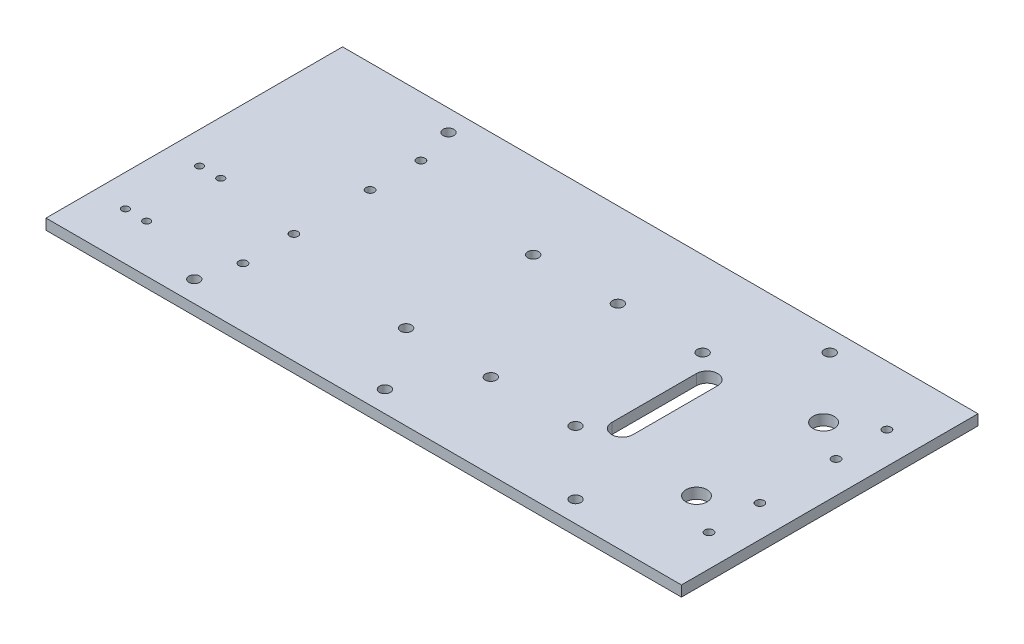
ISO-10303-21;
HEADER;
FILE_DESCRIPTION(('STEP AP214'),'2;1');
FILE_NAME('part.step','',(''),(''),'','','');
FILE_SCHEMA(('AUTOMOTIVE_DESIGN { 1 0 10303 214 1 1 1 1 }'));
ENDSEC;
DATA;
#1=APPLICATION_CONTEXT('core data for automotive mechanical design processes');
#2=APPLICATION_PROTOCOL_DEFINITION('international standard','automotive_design',2000,#1);
#3=PRODUCT_CONTEXT('',#1,'mechanical');
#4=PRODUCT('Part','Part','',(#3));
#5=PRODUCT_RELATED_PRODUCT_CATEGORY('part','',(#4));
#6=PRODUCT_DEFINITION_FORMATION('','',#4);
#7=PRODUCT_DEFINITION_CONTEXT('part definition',#1,'design');
#8=PRODUCT_DEFINITION('design','',#6,#7);
#9=PRODUCT_DEFINITION_SHAPE('','',#8);
#10=(LENGTH_UNIT() NAMED_UNIT(*) SI_UNIT(.MILLI.,.METRE.));
#11=(NAMED_UNIT(*) PLANE_ANGLE_UNIT() SI_UNIT($,.RADIAN.));
#12=(NAMED_UNIT(*) SI_UNIT($,.STERADIAN.) SOLID_ANGLE_UNIT());
#13=UNCERTAINTY_MEASURE_WITH_UNIT(LENGTH_MEASURE(1.E-05),#10,'distance_accuracy_value','');
#14=(GEOMETRIC_REPRESENTATION_CONTEXT(3) GLOBAL_UNCERTAINTY_ASSIGNED_CONTEXT((#13)) GLOBAL_UNIT_ASSIGNED_CONTEXT((#10,
#11,#12)) REPRESENTATION_CONTEXT('',''));
#15=CARTESIAN_POINT('',(0.,0.,0.));
#16=DIRECTION('',(0.,0.,1.));
#17=DIRECTION('',(1.,0.,0.));
#18=AXIS2_PLACEMENT_3D('',#15,#16,#17);
#19=CARTESIAN_POINT('',(0.,6.35,0.));
#20=DIRECTION('',(0.,-1.,0.));
#21=DIRECTION('',(0.,0.,-1.));
#22=AXIS2_PLACEMENT_3D('',#19,#20,#21);
#23=PLANE('',#22);
#24=DIRECTION('',(0.,0.,1.));
#25=VECTOR('',#24,1.);
#26=CARTESIAN_POINT('',(-190.5,6.35,88.9));
#27=LINE('',#26,#25);
#28=CARTESIAN_POINT('',(-190.5,6.35,-88.9));
#29=VERTEX_POINT('',#28);
#30=CARTESIAN_POINT('',(-190.5,6.35,88.9));
#31=VERTEX_POINT('',#30);
#32=EDGE_CURVE('E374',#29,#31,#27,.T.);
#33=ORIENTED_EDGE('',*,*,#32,.T.);
#34=DIRECTION('',(1.,0.,0.));
#35=VECTOR('',#34,1.);
#36=CARTESIAN_POINT('',(-190.5,6.35,88.9));
#37=LINE('',#36,#35);
#38=CARTESIAN_POINT('',(190.5,6.35,88.9));
#39=VERTEX_POINT('',#38);
#40=EDGE_CURVE('E103',#31,#39,#37,.T.);
#41=ORIENTED_EDGE('',*,*,#40,.T.);
#42=DIRECTION('',(0.,0.,-1.));
#43=VECTOR('',#42,1.);
#44=CARTESIAN_POINT('',(190.5,6.35,88.9));
#45=LINE('',#44,#43);
#46=CARTESIAN_POINT('',(190.5,6.35,-88.9));
#47=VERTEX_POINT('',#46);
#48=EDGE_CURVE('E379',#39,#47,#45,.T.);
#49=ORIENTED_EDGE('',*,*,#48,.T.);
#50=DIRECTION('',(-1.,0.,0.));
#51=VECTOR('',#50,1.);
#52=CARTESIAN_POINT('',(-190.5,6.35,-88.9));
#53=LINE('',#52,#51);
#54=EDGE_CURVE('E75',#47,#29,#53,.T.);
#55=ORIENTED_EDGE('',*,*,#54,.T.);
#56=EDGE_LOOP('',(#33,#41,#49,#55));
#57=FACE_BOUND('',#56,.T.);
#58=CARTESIAN_POINT('',(0.,6.35,76.2));
#59=DIRECTION('',(0.,-1.,0.));
#60=DIRECTION('',(0.,0.,-1.));
#61=AXIS2_PLACEMENT_3D('',#58,#59,#60);
#62=CIRCLE('',#61,3.2639);
#63=CARTESIAN_POINT('',(0.,6.35,72.9361));
#64=VERTEX_POINT('',#63);
#65=EDGE_CURVE('E369',#64,#64,#62,.F.);
#66=ORIENTED_EDGE('',*,*,#65,.F.);
#67=EDGE_LOOP('',(#66));
#68=FACE_BOUND('',#67,.T.);
#69=CARTESIAN_POINT('',(-114.3,6.35,76.2));
#70=DIRECTION('',(0.,-1.,0.));
#71=DIRECTION('',(0.,0.,-1.));
#72=AXIS2_PLACEMENT_3D('',#69,#70,#71);
#73=CIRCLE('',#72,3.26389999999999);
#74=CARTESIAN_POINT('',(-114.3,6.35,72.9361));
#75=VERTEX_POINT('',#74);
#76=EDGE_CURVE('E338',#75,#75,#73,.F.);
#77=ORIENTED_EDGE('',*,*,#76,.F.);
#78=EDGE_LOOP('',(#77));
#79=FACE_BOUND('',#78,.T.);
#80=CARTESIAN_POINT('',(114.3,6.35,76.2));
#81=DIRECTION('',(0.,-1.,0.));
#82=DIRECTION('',(0.,0.,-1.));
#83=AXIS2_PLACEMENT_3D('',#80,#81,#82);
#84=CIRCLE('',#83,3.26389999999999);
#85=CARTESIAN_POINT('',(114.3,6.35,72.9361));
#86=VERTEX_POINT('',#85);
#87=EDGE_CURVE('E339',#86,#86,#84,.F.);
#88=ORIENTED_EDGE('',*,*,#87,.F.);
#89=EDGE_LOOP('',(#88));
#90=FACE_BOUND('',#89,.T.);
#91=CARTESIAN_POINT('',(-114.3,6.35,-76.2));
#92=DIRECTION('',(0.,-1.,0.));
#93=DIRECTION('',(0.,0.,-1.));
#94=AXIS2_PLACEMENT_3D('',#91,#92,#93);
#95=CIRCLE('',#94,3.26389999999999);
#96=CARTESIAN_POINT('',(-114.3,6.35,-79.4639));
#97=VERTEX_POINT('',#96);
#98=EDGE_CURVE('E348',#97,#97,#95,.F.);
#99=ORIENTED_EDGE('',*,*,#98,.F.);
#100=EDGE_LOOP('',(#99));
#101=FACE_BOUND('',#100,.T.);
#102=CARTESIAN_POINT('',(114.3,6.35,-76.2));
#103=DIRECTION('',(0.,-1.,0.));
#104=DIRECTION('',(0.,0.,-1.));
#105=AXIS2_PLACEMENT_3D('',#102,#103,#104);
#106=CIRCLE('',#105,3.26389999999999);
#107=CARTESIAN_POINT('',(114.3,6.35,-79.4639));
#108=VERTEX_POINT('',#107);
#109=EDGE_CURVE('E356',#108,#108,#106,.F.);
#110=ORIENTED_EDGE('',*,*,#109,.F.);
#111=EDGE_LOOP('',(#110));
#112=FACE_BOUND('',#111,.T.);
#113=CARTESIAN_POINT('',(-107.95,6.35,22.86));
#114=DIRECTION('',(0.,-1.,0.));
#115=DIRECTION('',(0.,0.,-1.));
#116=AXIS2_PLACEMENT_3D('',#113,#114,#115);
#117=CIRCLE('',#116,2.5019);
#118=CARTESIAN_POINT('',(-107.95,6.35,20.3581));
#119=VERTEX_POINT('',#118);
#120=EDGE_CURVE('E329',#119,#119,#117,.F.);
#121=ORIENTED_EDGE('',*,*,#120,.F.);
#122=EDGE_LOOP('',(#121));
#123=FACE_BOUND('',#122,.T.);
#124=CARTESIAN_POINT('',(-107.95,6.35,53.34));
#125=DIRECTION('',(0.,-1.,0.));
#126=DIRECTION('',(0.,0.,-1.));
#127=AXIS2_PLACEMENT_3D('',#124,#125,#126);
#128=CIRCLE('',#127,2.50190000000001);
#129=CARTESIAN_POINT('',(-107.95,6.35,50.8381));
#130=VERTEX_POINT('',#129);
#131=EDGE_CURVE('E284',#130,#130,#128,.F.);
#132=ORIENTED_EDGE('',*,*,#131,.F.);
#133=EDGE_LOOP('',(#132));
#134=FACE_BOUND('',#133,.T.);
#135=CARTESIAN_POINT('',(171.45,6.35,22.86));
#136=DIRECTION('',(0.,-1.,0.));
#137=DIRECTION('',(0.,0.,-1.));
#138=AXIS2_PLACEMENT_3D('',#135,#136,#137);
#139=CIRCLE('',#138,2.5019);
#140=CARTESIAN_POINT('',(171.45,6.35,20.3581));
#141=VERTEX_POINT('',#140);
#142=EDGE_CURVE('E275',#141,#141,#139,.F.);
#143=ORIENTED_EDGE('',*,*,#142,.F.);
#144=EDGE_LOOP('',(#143));
#145=FACE_BOUND('',#144,.T.);
#146=CARTESIAN_POINT('',(-107.95,6.35,-53.34));
#147=DIRECTION('',(0.,-1.,0.));
#148=DIRECTION('',(0.,0.,-1.));
#149=AXIS2_PLACEMENT_3D('',#146,#147,#148);
#150=CIRCLE('',#149,2.50190000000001);
#151=CARTESIAN_POINT('',(-107.95,6.35,-55.8419));
#152=VERTEX_POINT('',#151);
#153=EDGE_CURVE('E274',#152,#152,#150,.F.);
#154=ORIENTED_EDGE('',*,*,#153,.F.);
#155=EDGE_LOOP('',(#154));
#156=FACE_BOUND('',#155,.T.);
#157=CARTESIAN_POINT('',(171.45,6.35,53.34));
#158=DIRECTION('',(0.,-1.,0.));
#159=DIRECTION('',(0.,0.,-1.));
#160=AXIS2_PLACEMENT_3D('',#157,#158,#159);
#161=CIRCLE('',#160,2.50190000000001);
#162=CARTESIAN_POINT('',(171.45,6.35,50.8381));
#163=VERTEX_POINT('',#162);
#164=EDGE_CURVE('E314',#163,#163,#161,.F.);
#165=ORIENTED_EDGE('',*,*,#164,.F.);
#166=EDGE_LOOP('',(#165));
#167=FACE_BOUND('',#166,.T.);
#168=CARTESIAN_POINT('',(171.45,6.35,-53.34));
#169=DIRECTION('',(0.,-1.,0.));
#170=DIRECTION('',(0.,0.,-1.));
#171=AXIS2_PLACEMENT_3D('',#168,#169,#170);
#172=CIRCLE('',#171,2.50190000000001);
#173=CARTESIAN_POINT('',(171.45,6.35,-55.8419));
#174=VERTEX_POINT('',#173);
#175=EDGE_CURVE('E315',#174,#174,#172,.F.);
#176=ORIENTED_EDGE('',*,*,#175,.F.);
#177=EDGE_LOOP('',(#176));
#178=FACE_BOUND('',#177,.T.);
#179=CARTESIAN_POINT('',(171.45,6.35,-22.86));
#180=DIRECTION('',(0.,-1.,0.));
#181=DIRECTION('',(0.,0.,-1.));
#182=AXIS2_PLACEMENT_3D('',#179,#180,#181);
#183=CIRCLE('',#182,2.5019);
#184=CARTESIAN_POINT('',(171.45,6.35,-25.3619));
#185=VERTEX_POINT('',#184);
#186=EDGE_CURVE('E298',#185,#185,#183,.F.);
#187=ORIENTED_EDGE('',*,*,#186,.F.);
#188=EDGE_LOOP('',(#187));
#189=FACE_BOUND('',#188,.T.);
#190=CARTESIAN_POINT('',(-107.95,6.35,-22.86));
#191=DIRECTION('',(0.,-1.,0.));
#192=DIRECTION('',(0.,0.,-1.));
#193=AXIS2_PLACEMENT_3D('',#190,#191,#192);
#194=CIRCLE('',#193,2.5019);
#195=CARTESIAN_POINT('',(-107.95,6.35,-25.3619));
#196=VERTEX_POINT('',#195);
#197=EDGE_CURVE('E299',#196,#196,#194,.F.);
#198=ORIENTED_EDGE('',*,*,#197,.F.);
#199=EDGE_LOOP('',(#198));
#200=FACE_BOUND('',#199,.T.);
#201=CARTESIAN_POINT('',(-171.45,6.35,60.325));
#202=DIRECTION('',(0.,-1.,0.));
#203=DIRECTION('',(0.,0.,-1.));
#204=AXIS2_PLACEMENT_3D('',#201,#202,#203);
#205=CIRCLE('',#204,2.15265000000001);
#206=CARTESIAN_POINT('',(-171.45,6.35,58.17235));
#207=VERTEX_POINT('',#206);
#208=EDGE_CURVE('E265',#207,#207,#205,.F.);
#209=ORIENTED_EDGE('',*,*,#208,.F.);
#210=EDGE_LOOP('',(#209));
#211=FACE_BOUND('',#210,.T.);
#212=CARTESIAN_POINT('',(-158.75,6.35,15.875));
#213=DIRECTION('',(0.,-1.,0.));
#214=DIRECTION('',(0.,0.,-1.));
#215=AXIS2_PLACEMENT_3D('',#212,#213,#214);
#216=CIRCLE('',#215,2.15265000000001);
#217=CARTESIAN_POINT('',(-158.75,6.35,13.72235));
#218=VERTEX_POINT('',#217);
#219=EDGE_CURVE('E241',#218,#218,#216,.F.);
#220=ORIENTED_EDGE('',*,*,#219,.F.);
#221=EDGE_LOOP('',(#220));
#222=FACE_BOUND('',#221,.T.);
#223=CARTESIAN_POINT('',(-171.45,6.35,15.875));
#224=DIRECTION('',(0.,-1.,0.));
#225=DIRECTION('',(0.,0.,-1.));
#226=AXIS2_PLACEMENT_3D('',#223,#224,#225);
#227=CIRCLE('',#226,2.15265000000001);
#228=CARTESIAN_POINT('',(-171.45,6.35,13.72235));
#229=VERTEX_POINT('',#228);
#230=EDGE_CURVE('E251',#229,#229,#227,.F.);
#231=ORIENTED_EDGE('',*,*,#230,.F.);
#232=EDGE_LOOP('',(#231));
#233=FACE_BOUND('',#232,.T.);
#234=CARTESIAN_POINT('',(-158.75,6.35,60.325));
#235=DIRECTION('',(0.,-1.,0.));
#236=DIRECTION('',(0.,0.,-1.));
#237=AXIS2_PLACEMENT_3D('',#234,#235,#236);
#238=CIRCLE('',#237,2.15265000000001);
#239=CARTESIAN_POINT('',(-158.75,6.35,58.17235));
#240=VERTEX_POINT('',#239);
#241=EDGE_CURVE('E250',#240,#240,#238,.F.);
#242=ORIENTED_EDGE('',*,*,#241,.F.);
#243=EDGE_LOOP('',(#242));
#244=FACE_BOUND('',#243,.T.);
#245=CARTESIAN_POINT('',(76.2,6.35,38.1));
#246=DIRECTION('',(0.,-1.,0.));
#247=DIRECTION('',(0.,0.,-1.));
#248=AXIS2_PLACEMENT_3D('',#245,#246,#247);
#249=CIRCLE('',#248,3.26389999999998);
#250=CARTESIAN_POINT('',(76.2,6.35,34.8361));
#251=VERTEX_POINT('',#250);
#252=EDGE_CURVE('E231',#251,#251,#249,.T.);
#253=ORIENTED_EDGE('',*,*,#252,.T.);
#254=EDGE_LOOP('',(#253));
#255=FACE_BOUND('',#254,.T.);
#256=CARTESIAN_POINT('',(25.4,6.35,38.1));
#257=DIRECTION('',(0.,-1.,0.));
#258=DIRECTION('',(0.,0.,-1.));
#259=AXIS2_PLACEMENT_3D('',#256,#257,#258);
#260=CIRCLE('',#259,3.2639);
#261=CARTESIAN_POINT('',(25.4,6.35,34.8361));
#262=VERTEX_POINT('',#261);
#263=EDGE_CURVE('E223',#262,#262,#260,.T.);
#264=ORIENTED_EDGE('',*,*,#263,.T.);
#265=EDGE_LOOP('',(#264));
#266=FACE_BOUND('',#265,.T.);
#267=CARTESIAN_POINT('',(-25.4,6.35,38.1));
#268=DIRECTION('',(0.,-1.,0.));
#269=DIRECTION('',(0.,0.,-1.));
#270=AXIS2_PLACEMENT_3D('',#267,#268,#269);
#271=CIRCLE('',#270,3.2639);
#272=CARTESIAN_POINT('',(-25.4,6.35,34.8361));
#273=VERTEX_POINT('',#272);
#274=EDGE_CURVE('E214',#273,#273,#271,.T.);
#275=ORIENTED_EDGE('',*,*,#274,.T.);
#276=EDGE_LOOP('',(#275));
#277=FACE_BOUND('',#276,.T.);
#278=CARTESIAN_POINT('',(76.2,6.35,-38.1));
#279=DIRECTION('',(0.,1.,0.));
#280=DIRECTION('',(0.,0.,1.));
#281=AXIS2_PLACEMENT_3D('',#278,#279,#280);
#282=CIRCLE('',#281,3.26389999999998);
#283=CARTESIAN_POINT('',(76.2,6.35,-34.8361));
#284=VERTEX_POINT('',#283);
#285=EDGE_CURVE('E207',#284,#284,#282,.T.);
#286=ORIENTED_EDGE('',*,*,#285,.F.);
#287=EDGE_LOOP('',(#286));
#288=FACE_BOUND('',#287,.T.);
#289=CARTESIAN_POINT('',(25.4,6.35,-38.1));
#290=DIRECTION('',(0.,1.,0.));
#291=DIRECTION('',(0.,0.,1.));
#292=AXIS2_PLACEMENT_3D('',#289,#290,#291);
#293=CIRCLE('',#292,3.2639);
#294=CARTESIAN_POINT('',(25.4,6.35,-34.8361));
#295=VERTEX_POINT('',#294);
#296=EDGE_CURVE('E199',#295,#295,#293,.T.);
#297=ORIENTED_EDGE('',*,*,#296,.F.);
#298=EDGE_LOOP('',(#297));
#299=FACE_BOUND('',#298,.T.);
#300=CARTESIAN_POINT('',(-25.4,6.35,-38.1));
#301=DIRECTION('',(0.,1.,0.));
#302=DIRECTION('',(0.,0.,1.));
#303=AXIS2_PLACEMENT_3D('',#300,#301,#302);
#304=CIRCLE('',#303,3.2639);
#305=CARTESIAN_POINT('',(-25.4,6.35,-34.8361));
#306=VERTEX_POINT('',#305);
#307=EDGE_CURVE('E190',#306,#306,#304,.T.);
#308=ORIENTED_EDGE('',*,*,#307,.F.);
#309=EDGE_LOOP('',(#308));
#310=FACE_BOUND('',#309,.T.);
#311=CARTESIAN_POINT('',(148.717,6.35,38.1));
#312=DIRECTION('',(0.,-1.,0.));
#313=DIRECTION('',(0.,0.,-1.));
#314=AXIS2_PLACEMENT_3D('',#311,#312,#313);
#315=CIRCLE('',#314,6.35);
#316=CARTESIAN_POINT('',(148.717,6.35,31.75));
#317=VERTEX_POINT('',#316);
#318=EDGE_CURVE('E163',#317,#317,#315,.T.);
#319=ORIENTED_EDGE('',*,*,#318,.T.);
#320=EDGE_LOOP('',(#319));
#321=FACE_BOUND('',#320,.T.);
#322=DIRECTION('',(0.,0.,-1.));
#323=VECTOR('',#322,1.);
#324=CARTESIAN_POINT('',(85.217,6.35,25.4));
#325=LINE('',#324,#323);
#326=CARTESIAN_POINT('',(85.217,6.35,25.4));
#327=VERTEX_POINT('',#326);
#328=CARTESIAN_POINT('',(85.217,6.35,-25.4));
#329=VERTEX_POINT('',#328);
#330=EDGE_CURVE('E138',#327,#329,#325,.T.);
#331=ORIENTED_EDGE('',*,*,#330,.T.);
#332=CARTESIAN_POINT('',(91.567,6.35,-25.4));
#333=DIRECTION('',(0.,1.,0.));
#334=DIRECTION('',(0.,0.,1.));
#335=AXIS2_PLACEMENT_3D('',#332,#333,#334);
#336=CIRCLE('',#335,6.34999999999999);
#337=CARTESIAN_POINT('',(97.917,6.35,-25.4));
#338=VERTEX_POINT('',#337);
#339=EDGE_CURVE('E144',#338,#329,#336,.T.);
#340=ORIENTED_EDGE('',*,*,#339,.F.);
#341=DIRECTION('',(0.,0.,1.));
#342=VECTOR('',#341,1.);
#343=CARTESIAN_POINT('',(97.917,6.35,0.));
#344=LINE('',#343,#342);
#345=CARTESIAN_POINT('',(97.917,6.35,25.4));
#346=VERTEX_POINT('',#345);
#347=EDGE_CURVE('E125',#338,#346,#344,.T.);
#348=ORIENTED_EDGE('',*,*,#347,.T.);
#349=CARTESIAN_POINT('',(91.567,6.35,25.4));
#350=DIRECTION('',(0.,-1.,0.));
#351=DIRECTION('',(0.,0.,-1.));
#352=AXIS2_PLACEMENT_3D('',#349,#350,#351);
#353=CIRCLE('',#352,6.34999999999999);
#354=EDGE_CURVE('E172',#346,#327,#353,.T.);
#355=ORIENTED_EDGE('',*,*,#354,.T.);
#356=EDGE_LOOP('',(#331,#340,#348,#355));
#357=FACE_BOUND('',#356,.T.);
#358=CARTESIAN_POINT('',(148.717,6.35,-38.1));
#359=DIRECTION('',(0.,1.,0.));
#360=DIRECTION('',(0.,0.,1.));
#361=AXIS2_PLACEMENT_3D('',#358,#359,#360);
#362=CIRCLE('',#361,6.35);
#363=CARTESIAN_POINT('',(148.717,6.35,-31.75));
#364=VERTEX_POINT('',#363);
#365=EDGE_CURVE('E181',#364,#364,#362,.T.);
#366=ORIENTED_EDGE('',*,*,#365,.F.);
#367=EDGE_LOOP('',(#366));
#368=FACE_BOUND('',#367,.T.);
#369=ADVANCED_FACE('F50',(#57,#68,#79,#90,#101,#112,#123,#134,#145,#156,#167,#178,#189,#200,
#211,#222,#233,#244,#255,#266,#277,#288,#299,#310,#321,#357,#368),#23,.F.);
#370=CARTESIAN_POINT('',(0.,0.,0.));
#371=DIRECTION('',(0.,-1.,0.));
#372=DIRECTION('',(0.,0.,-1.));
#373=AXIS2_PLACEMENT_3D('',#370,#371,#372);
#374=PLANE('',#373);
#375=CARTESIAN_POINT('',(91.567,0.,-25.4));
#376=DIRECTION('',(0.,1.,0.));
#377=DIRECTION('',(0.,0.,1.));
#378=AXIS2_PLACEMENT_3D('',#375,#376,#377);
#379=CIRCLE('',#378,6.34999999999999);
#380=CARTESIAN_POINT('',(97.917,0.,-25.4));
#381=VERTEX_POINT('',#380);
#382=CARTESIAN_POINT('',(85.217,0.,-25.4));
#383=VERTEX_POINT('',#382);
#384=EDGE_CURVE('E147',#381,#383,#379,.T.);
#385=ORIENTED_EDGE('',*,*,#384,.T.);
#386=DIRECTION('',(0.,0.,-1.));
#387=VECTOR('',#386,1.);
#388=CARTESIAN_POINT('',(85.217,0.,25.4));
#389=LINE('',#388,#387);
#390=CARTESIAN_POINT('',(85.217,0.,25.4));
#391=VERTEX_POINT('',#390);
#392=EDGE_CURVE('E180',#391,#383,#389,.T.);
#393=ORIENTED_EDGE('',*,*,#392,.F.);
#394=CARTESIAN_POINT('',(91.567,0.,25.4));
#395=DIRECTION('',(0.,-1.,0.));
#396=DIRECTION('',(0.,0.,-1.));
#397=AXIS2_PLACEMENT_3D('',#394,#395,#396);
#398=CIRCLE('',#397,6.34999999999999);
#399=CARTESIAN_POINT('',(97.917,0.,25.4));
#400=VERTEX_POINT('',#399);
#401=EDGE_CURVE('E66',#400,#391,#398,.T.);
#402=ORIENTED_EDGE('',*,*,#401,.F.);
#403=DIRECTION('',(0.,0.,1.));
#404=VECTOR('',#403,1.);
#405=CARTESIAN_POINT('',(97.917,0.,0.));
#406=LINE('',#405,#404);
#407=EDGE_CURVE('E175',#381,#400,#406,.T.);
#408=ORIENTED_EDGE('',*,*,#407,.F.);
#409=EDGE_LOOP('',(#385,#393,#402,#408));
#410=FACE_BOUND('',#409,.T.);
#411=DIRECTION('',(0.,0.,1.));
#412=VECTOR('',#411,1.);
#413=CARTESIAN_POINT('',(-190.5,0.,88.9));
#414=LINE('',#413,#412);
#415=CARTESIAN_POINT('',(-190.5,0.,-88.9));
#416=VERTEX_POINT('',#415);
#417=CARTESIAN_POINT('',(-190.5,0.,88.9));
#418=VERTEX_POINT('',#417);
#419=EDGE_CURVE('E373',#416,#418,#414,.T.);
#420=ORIENTED_EDGE('',*,*,#419,.F.);
#421=DIRECTION('',(-1.,0.,0.));
#422=VECTOR('',#421,1.);
#423=CARTESIAN_POINT('',(-190.5,0.,-88.9));
#424=LINE('',#423,#422);
#425=CARTESIAN_POINT('',(190.5,0.,-88.9));
#426=VERTEX_POINT('',#425);
#427=EDGE_CURVE('E96',#426,#416,#424,.T.);
#428=ORIENTED_EDGE('',*,*,#427,.F.);
#429=DIRECTION('',(0.,0.,-1.));
#430=VECTOR('',#429,1.);
#431=CARTESIAN_POINT('',(190.5,0.,88.9));
#432=LINE('',#431,#430);
#433=CARTESIAN_POINT('',(190.5,0.,88.9));
#434=VERTEX_POINT('',#433);
#435=EDGE_CURVE('E391',#434,#426,#432,.T.);
#436=ORIENTED_EDGE('',*,*,#435,.F.);
#437=DIRECTION('',(1.,0.,0.));
#438=VECTOR('',#437,1.);
#439=CARTESIAN_POINT('',(-190.5,0.,88.9));
#440=LINE('',#439,#438);
#441=EDGE_CURVE('E388',#418,#434,#440,.T.);
#442=ORIENTED_EDGE('',*,*,#441,.F.);
#443=EDGE_LOOP('',(#420,#428,#436,#442));
#444=FACE_BOUND('',#443,.T.);
#445=CARTESIAN_POINT('',(0.,0.,76.2));
#446=DIRECTION('',(0.,-1.,0.));
#447=DIRECTION('',(0.,0.,-1.));
#448=AXIS2_PLACEMENT_3D('',#445,#446,#447);
#449=CIRCLE('',#448,3.2639);
#450=CARTESIAN_POINT('',(0.,0.,72.9361));
#451=VERTEX_POINT('',#450);
#452=EDGE_CURVE('E343',#451,#451,#449,.T.);
#453=ORIENTED_EDGE('',*,*,#452,.F.);
#454=EDGE_LOOP('',(#453));
#455=FACE_BOUND('',#454,.T.);
#456=CARTESIAN_POINT('',(-114.3,0.,76.2));
#457=DIRECTION('',(0.,-1.,0.));
#458=DIRECTION('',(0.,0.,-1.));
#459=AXIS2_PLACEMENT_3D('',#456,#457,#458);
#460=CIRCLE('',#459,3.26389999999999);
#461=CARTESIAN_POINT('',(-114.3,0.,72.9361));
#462=VERTEX_POINT('',#461);
#463=EDGE_CURVE('E334',#462,#462,#460,.T.);
#464=ORIENTED_EDGE('',*,*,#463,.F.);
#465=EDGE_LOOP('',(#464));
#466=FACE_BOUND('',#465,.T.);
#467=CARTESIAN_POINT('',(114.3,0.,76.2));
#468=DIRECTION('',(0.,-1.,0.));
#469=DIRECTION('',(0.,0.,-1.));
#470=AXIS2_PLACEMENT_3D('',#467,#468,#469);
#471=CIRCLE('',#470,3.26389999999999);
#472=CARTESIAN_POINT('',(114.3,0.,72.9361));
#473=VERTEX_POINT('',#472);
#474=EDGE_CURVE('E344',#473,#473,#471,.T.);
#475=ORIENTED_EDGE('',*,*,#474,.F.);
#476=EDGE_LOOP('',(#475));
#477=FACE_BOUND('',#476,.T.);
#478=CARTESIAN_POINT('',(-114.3,0.,-76.2));
#479=DIRECTION('',(0.,-1.,0.));
#480=DIRECTION('',(0.,0.,-1.));
#481=AXIS2_PLACEMENT_3D('',#478,#479,#480);
#482=CIRCLE('',#481,3.26389999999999);
#483=CARTESIAN_POINT('',(-114.3,0.,-79.4639));
#484=VERTEX_POINT('',#483);
#485=EDGE_CURVE('E352',#484,#484,#482,.T.);
#486=ORIENTED_EDGE('',*,*,#485,.F.);
#487=EDGE_LOOP('',(#486));
#488=FACE_BOUND('',#487,.T.);
#489=CARTESIAN_POINT('',(114.3,0.,-76.2));
#490=DIRECTION('',(0.,-1.,0.));
#491=DIRECTION('',(0.,0.,-1.));
#492=AXIS2_PLACEMENT_3D('',#489,#490,#491);
#493=CIRCLE('',#492,3.26389999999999);
#494=CARTESIAN_POINT('',(114.3,0.,-79.4639));
#495=VERTEX_POINT('',#494);
#496=EDGE_CURVE('E333',#495,#495,#493,.T.);
#497=ORIENTED_EDGE('',*,*,#496,.F.);
#498=EDGE_LOOP('',(#497));
#499=FACE_BOUND('',#498,.T.);
#500=CARTESIAN_POINT('',(-107.95,0.,22.86));
#501=DIRECTION('',(0.,-1.,0.));
#502=DIRECTION('',(0.,0.,-1.));
#503=AXIS2_PLACEMENT_3D('',#500,#501,#502);
#504=CIRCLE('',#503,2.5019);
#505=CARTESIAN_POINT('',(-107.95,0.,20.3581));
#506=VERTEX_POINT('',#505);
#507=EDGE_CURVE('E319',#506,#506,#504,.T.);
#508=ORIENTED_EDGE('',*,*,#507,.F.);
#509=EDGE_LOOP('',(#508));
#510=FACE_BOUND('',#509,.T.);
#511=CARTESIAN_POINT('',(-107.95,0.,53.34));
#512=DIRECTION('',(0.,-1.,0.));
#513=DIRECTION('',(0.,0.,1.));
#514=AXIS2_PLACEMENT_3D('',#511,#512,#513);
#515=CIRCLE('',#514,2.50190000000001);
#516=CARTESIAN_POINT('',(-107.95,0.,55.8419));
#517=VERTEX_POINT('',#516);
#518=EDGE_CURVE('E269',#517,#517,#515,.T.);
#519=ORIENTED_EDGE('',*,*,#518,.F.);
#520=EDGE_LOOP('',(#519));
#521=FACE_BOUND('',#520,.T.);
#522=CARTESIAN_POINT('',(171.45,0.,22.86));
#523=DIRECTION('',(0.,-1.,0.));
#524=DIRECTION('',(0.,0.,-1.));
#525=AXIS2_PLACEMENT_3D('',#522,#523,#524);
#526=CIRCLE('',#525,2.5019);
#527=CARTESIAN_POINT('',(171.45,0.,20.3581));
#528=VERTEX_POINT('',#527);
#529=EDGE_CURVE('E280',#528,#528,#526,.T.);
#530=ORIENTED_EDGE('',*,*,#529,.F.);
#531=EDGE_LOOP('',(#530));
#532=FACE_BOUND('',#531,.T.);
#533=CARTESIAN_POINT('',(-107.95,0.,-53.34));
#534=DIRECTION('',(0.,-1.,0.));
#535=DIRECTION('',(0.,0.,-1.));
#536=AXIS2_PLACEMENT_3D('',#533,#534,#535);
#537=CIRCLE('',#536,2.50190000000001);
#538=CARTESIAN_POINT('',(-107.95,0.,-55.8419));
#539=VERTEX_POINT('',#538);
#540=EDGE_CURVE('E270',#539,#539,#537,.T.);
#541=ORIENTED_EDGE('',*,*,#540,.F.);
#542=EDGE_LOOP('',(#541));
#543=FACE_BOUND('',#542,.T.);
#544=CARTESIAN_POINT('',(171.45,0.,53.34));
#545=DIRECTION('',(0.,-1.,0.));
#546=DIRECTION('',(0.,0.,-1.));
#547=AXIS2_PLACEMENT_3D('',#544,#545,#546);
#548=CIRCLE('',#547,2.50190000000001);
#549=CARTESIAN_POINT('',(171.45,0.,50.8381));
#550=VERTEX_POINT('',#549);
#551=EDGE_CURVE('E310',#550,#550,#548,.T.);
#552=ORIENTED_EDGE('',*,*,#551,.F.);
#553=EDGE_LOOP('',(#552));
#554=FACE_BOUND('',#553,.T.);
#555=CARTESIAN_POINT('',(171.45,0.,-53.34));
#556=DIRECTION('',(0.,-1.,0.));
#557=DIRECTION('',(0.,0.,1.));
#558=AXIS2_PLACEMENT_3D('',#555,#556,#557);
#559=CIRCLE('',#558,2.50190000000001);
#560=CARTESIAN_POINT('',(171.45,0.,-50.8381));
#561=VERTEX_POINT('',#560);
#562=EDGE_CURVE('E303',#561,#561,#559,.T.);
#563=ORIENTED_EDGE('',*,*,#562,.F.);
#564=EDGE_LOOP('',(#563));
#565=FACE_BOUND('',#564,.T.);
#566=CARTESIAN_POINT('',(171.45,0.,-22.86));
#567=DIRECTION('',(0.,-1.,0.));
#568=DIRECTION('',(0.,0.,1.));
#569=AXIS2_PLACEMENT_3D('',#566,#567,#568);
#570=CIRCLE('',#569,2.5019);
#571=CARTESIAN_POINT('',(171.45,0.,-20.3581));
#572=VERTEX_POINT('',#571);
#573=EDGE_CURVE('E294',#572,#572,#570,.T.);
#574=ORIENTED_EDGE('',*,*,#573,.F.);
#575=EDGE_LOOP('',(#574));
#576=FACE_BOUND('',#575,.T.);
#577=CARTESIAN_POINT('',(-107.95,0.,-22.86));
#578=DIRECTION('',(0.,-1.,0.));
#579=DIRECTION('',(0.,0.,1.));
#580=AXIS2_PLACEMENT_3D('',#577,#578,#579);
#581=CIRCLE('',#580,2.5019);
#582=CARTESIAN_POINT('',(-107.95,0.,-20.3581));
#583=VERTEX_POINT('',#582);
#584=EDGE_CURVE('E279',#583,#583,#581,.T.);
#585=ORIENTED_EDGE('',*,*,#584,.F.);
#586=EDGE_LOOP('',(#585));
#587=FACE_BOUND('',#586,.T.);
#588=CARTESIAN_POINT('',(-171.45,0.,60.325));
#589=DIRECTION('',(0.,-1.,0.));
#590=DIRECTION('',(0.,0.,-1.));
#591=AXIS2_PLACEMENT_3D('',#588,#589,#590);
#592=CIRCLE('',#591,2.15265000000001);
#593=CARTESIAN_POINT('',(-171.45,0.,58.17235));
#594=VERTEX_POINT('',#593);
#595=EDGE_CURVE('E255',#594,#594,#592,.T.);
#596=ORIENTED_EDGE('',*,*,#595,.F.);
#597=EDGE_LOOP('',(#596));
#598=FACE_BOUND('',#597,.T.);
#599=CARTESIAN_POINT('',(-158.75,0.,15.875));
#600=DIRECTION('',(0.,-1.,0.));
#601=DIRECTION('',(0.,0.,-1.));
#602=AXIS2_PLACEMENT_3D('',#599,#600,#601);
#603=CIRCLE('',#602,2.15265000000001);
#604=CARTESIAN_POINT('',(-158.75,0.,13.72235));
#605=VERTEX_POINT('',#604);
#606=EDGE_CURVE('E218',#605,#605,#603,.T.);
#607=ORIENTED_EDGE('',*,*,#606,.F.);
#608=EDGE_LOOP('',(#607));
#609=FACE_BOUND('',#608,.T.);
#610=CARTESIAN_POINT('',(-171.45,0.,15.875));
#611=DIRECTION('',(0.,-1.,0.));
#612=DIRECTION('',(0.,0.,-1.));
#613=AXIS2_PLACEMENT_3D('',#610,#611,#612);
#614=CIRCLE('',#613,2.15265000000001);
#615=CARTESIAN_POINT('',(-171.45,0.,13.72235));
#616=VERTEX_POINT('',#615);
#617=EDGE_CURVE('E245',#616,#616,#614,.T.);
#618=ORIENTED_EDGE('',*,*,#617,.F.);
#619=EDGE_LOOP('',(#618));
#620=FACE_BOUND('',#619,.T.);
#621=CARTESIAN_POINT('',(-158.75,0.,60.325));
#622=DIRECTION('',(0.,-1.,0.));
#623=DIRECTION('',(0.,0.,-1.));
#624=AXIS2_PLACEMENT_3D('',#621,#622,#623);
#625=CIRCLE('',#624,2.15265000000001);
#626=CARTESIAN_POINT('',(-158.75,0.,58.17235));
#627=VERTEX_POINT('',#626);
#628=EDGE_CURVE('E246',#627,#627,#625,.T.);
#629=ORIENTED_EDGE('',*,*,#628,.F.);
#630=EDGE_LOOP('',(#629));
#631=FACE_BOUND('',#630,.T.);
#632=CARTESIAN_POINT('',(76.2,0.,38.1));
#633=DIRECTION('',(0.,-1.,0.));
#634=DIRECTION('',(0.,0.,-1.));
#635=AXIS2_PLACEMENT_3D('',#632,#633,#634);
#636=CIRCLE('',#635,3.26389999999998);
#637=CARTESIAN_POINT('',(76.2,0.,34.8361));
#638=VERTEX_POINT('',#637);
#639=EDGE_CURVE('E194',#638,#638,#636,.T.);
#640=ORIENTED_EDGE('',*,*,#639,.F.);
#641=EDGE_LOOP('',(#640));
#642=FACE_BOUND('',#641,.T.);
#643=CARTESIAN_POINT('',(25.4,0.,38.1));
#644=DIRECTION('',(0.,-1.,0.));
#645=DIRECTION('',(0.,0.,-1.));
#646=AXIS2_PLACEMENT_3D('',#643,#644,#645);
#647=CIRCLE('',#646,3.2639);
#648=CARTESIAN_POINT('',(25.4,0.,34.8361));
#649=VERTEX_POINT('',#648);
#650=EDGE_CURVE('E227',#649,#649,#647,.T.);
#651=ORIENTED_EDGE('',*,*,#650,.F.);
#652=EDGE_LOOP('',(#651));
#653=FACE_BOUND('',#652,.T.);
#654=CARTESIAN_POINT('',(-25.4,0.,38.1));
#655=DIRECTION('',(0.,-1.,0.));
#656=DIRECTION('',(0.,0.,-1.));
#657=AXIS2_PLACEMENT_3D('',#654,#655,#656);
#658=CIRCLE('',#657,3.2639);
#659=CARTESIAN_POINT('',(-25.4,0.,34.8361));
#660=VERTEX_POINT('',#659);
#661=EDGE_CURVE('E219',#660,#660,#658,.T.);
#662=ORIENTED_EDGE('',*,*,#661,.F.);
#663=EDGE_LOOP('',(#662));
#664=FACE_BOUND('',#663,.T.);
#665=CARTESIAN_POINT('',(76.2,0.,-38.1));
#666=DIRECTION('',(0.,1.,0.));
#667=DIRECTION('',(0.,0.,1.));
#668=AXIS2_PLACEMENT_3D('',#665,#666,#667);
#669=CIRCLE('',#668,3.26389999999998);
#670=CARTESIAN_POINT('',(76.2,0.,-34.8361));
#671=VERTEX_POINT('',#670);
#672=EDGE_CURVE('E167',#671,#671,#669,.T.);
#673=ORIENTED_EDGE('',*,*,#672,.T.);
#674=EDGE_LOOP('',(#673));
#675=FACE_BOUND('',#674,.T.);
#676=CARTESIAN_POINT('',(25.4,0.,-38.1));
#677=DIRECTION('',(0.,1.,0.));
#678=DIRECTION('',(0.,0.,1.));
#679=AXIS2_PLACEMENT_3D('',#676,#677,#678);
#680=CIRCLE('',#679,3.2639);
#681=CARTESIAN_POINT('',(25.4,0.,-34.8361));
#682=VERTEX_POINT('',#681);
#683=EDGE_CURVE('E203',#682,#682,#680,.T.);
#684=ORIENTED_EDGE('',*,*,#683,.T.);
#685=EDGE_LOOP('',(#684));
#686=FACE_BOUND('',#685,.T.);
#687=CARTESIAN_POINT('',(-25.4,0.,-38.1));
#688=DIRECTION('',(0.,1.,0.));
#689=DIRECTION('',(0.,0.,1.));
#690=AXIS2_PLACEMENT_3D('',#687,#688,#689);
#691=CIRCLE('',#690,3.2639);
#692=CARTESIAN_POINT('',(-25.4,0.,-34.8361));
#693=VERTEX_POINT('',#692);
#694=EDGE_CURVE('E195',#693,#693,#691,.T.);
#695=ORIENTED_EDGE('',*,*,#694,.T.);
#696=EDGE_LOOP('',(#695));
#697=FACE_BOUND('',#696,.T.);
#698=CARTESIAN_POINT('',(148.717,0.,38.1));
#699=DIRECTION('',(0.,-1.,0.));
#700=DIRECTION('',(0.,0.,-1.));
#701=AXIS2_PLACEMENT_3D('',#698,#699,#700);
#702=CIRCLE('',#701,6.35);
#703=CARTESIAN_POINT('',(148.717,0.,31.75));
#704=VERTEX_POINT('',#703);
#705=EDGE_CURVE('E168',#704,#704,#702,.T.);
#706=ORIENTED_EDGE('',*,*,#705,.F.);
#707=EDGE_LOOP('',(#706));
#708=FACE_BOUND('',#707,.T.);
#709=CARTESIAN_POINT('',(148.717,0.,-38.1));
#710=DIRECTION('',(0.,1.,0.));
#711=DIRECTION('',(0.,0.,1.));
#712=AXIS2_PLACEMENT_3D('',#709,#710,#711);
#713=CIRCLE('',#712,6.35);
#714=CARTESIAN_POINT('',(148.717,0.,-31.75));
#715=VERTEX_POINT('',#714);
#716=EDGE_CURVE('E158',#715,#715,#713,.T.);
#717=ORIENTED_EDGE('',*,*,#716,.T.);
#718=EDGE_LOOP('',(#717));
#719=FACE_BOUND('',#718,.T.);
#720=ADVANCED_FACE('F409',(#410,#444,#455,#466,#477,#488,#499,#510,#521,#532,#543,#554,#565,
#576,#587,#598,#609,#620,#631,#642,#653,#664,#675,#686,#697,#708,#719),#374,.T.);
#721=CARTESIAN_POINT('',(-190.5,6.35,88.9));
#722=DIRECTION('',(1.,0.,0.));
#723=DIRECTION('',(0.,0.,-1.));
#724=AXIS2_PLACEMENT_3D('',#721,#722,#723);
#725=PLANE('',#724);
#726=ORIENTED_EDGE('',*,*,#419,.T.);
#727=DIRECTION('',(0.,-1.,0.));
#728=VECTOR('',#727,1.);
#729=CARTESIAN_POINT('',(-190.5,6.35,88.9));
#730=LINE('',#729,#728);
#731=EDGE_CURVE('E13',#31,#418,#730,.T.);
#732=ORIENTED_EDGE('',*,*,#731,.F.);
#733=ORIENTED_EDGE('',*,*,#32,.F.);
#734=DIRECTION('',(0.,-1.,0.));
#735=VECTOR('',#734,1.);
#736=CARTESIAN_POINT('',(-190.5,6.35,-88.9));
#737=LINE('',#736,#735);
#738=EDGE_CURVE('E384',#29,#416,#737,.T.);
#739=ORIENTED_EDGE('',*,*,#738,.T.);
#740=EDGE_LOOP('',(#726,#732,#733,#739));
#741=FACE_BOUND('',#740,.T.);
#742=ADVANCED_FACE('F52',(#741),#725,.F.);
#743=CARTESIAN_POINT('',(-190.5,6.35,88.9));
#744=DIRECTION('',(0.,0.,-1.));
#745=DIRECTION('',(-1.,0.,0.));
#746=AXIS2_PLACEMENT_3D('',#743,#744,#745);
#747=PLANE('',#746);
#748=ORIENTED_EDGE('',*,*,#441,.T.);
#749=DIRECTION('',(0.,-1.,0.));
#750=VECTOR('',#749,1.);
#751=CARTESIAN_POINT('',(190.5,6.35,88.9));
#752=LINE('',#751,#750);
#753=EDGE_CURVE('E59',#39,#434,#752,.T.);
#754=ORIENTED_EDGE('',*,*,#753,.F.);
#755=ORIENTED_EDGE('',*,*,#40,.F.);
#756=ORIENTED_EDGE('',*,*,#731,.T.);
#757=EDGE_LOOP('',(#748,#754,#755,#756));
#758=FACE_BOUND('',#757,.T.);
#759=ADVANCED_FACE('F425',(#758),#747,.F.);
#760=CARTESIAN_POINT('',(190.5,6.35,88.9));
#761=DIRECTION('',(-1.,0.,0.));
#762=DIRECTION('',(0.,0.,1.));
#763=AXIS2_PLACEMENT_3D('',#760,#761,#762);
#764=PLANE('',#763);
#765=ORIENTED_EDGE('',*,*,#435,.T.);
#766=DIRECTION('',(0.,-1.,0.));
#767=VECTOR('',#766,1.);
#768=CARTESIAN_POINT('',(190.5,6.35,-88.9));
#769=LINE('',#768,#767);
#770=EDGE_CURVE('E398',#47,#426,#769,.T.);
#771=ORIENTED_EDGE('',*,*,#770,.F.);
#772=ORIENTED_EDGE('',*,*,#48,.F.);
#773=ORIENTED_EDGE('',*,*,#753,.T.);
#774=EDGE_LOOP('',(#765,#771,#772,#773));
#775=FACE_BOUND('',#774,.T.);
#776=ADVANCED_FACE('F405',(#775),#764,.F.);
#777=CARTESIAN_POINT('',(-190.5,6.35,-88.9));
#778=DIRECTION('',(0.,0.,1.));
#779=DIRECTION('',(1.,0.,0.));
#780=AXIS2_PLACEMENT_3D('',#777,#778,#779);
#781=PLANE('',#780);
#782=ORIENTED_EDGE('',*,*,#427,.T.);
#783=ORIENTED_EDGE('',*,*,#738,.F.);
#784=ORIENTED_EDGE('',*,*,#54,.F.);
#785=ORIENTED_EDGE('',*,*,#770,.T.);
#786=EDGE_LOOP('',(#782,#783,#784,#785));
#787=FACE_BOUND('',#786,.T.);
#788=ADVANCED_FACE('F414',(#787),#781,.F.);
#789=CARTESIAN_POINT('',(0.,15.5817032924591,76.2));
#790=DIRECTION('',(0.,-1.,0.));
#791=DIRECTION('',(0.,0.,-1.));
#792=AXIS2_PLACEMENT_3D('',#789,#790,#791);
#793=CYLINDRICAL_SURFACE('',#792,3.2639);
#794=ORIENTED_EDGE('',*,*,#65,.T.);
#795=EDGE_LOOP('',(#794));
#796=FACE_BOUND('',#795,.T.);
#797=ORIENTED_EDGE('',*,*,#452,.T.);
#798=EDGE_LOOP('',(#797));
#799=FACE_BOUND('',#798,.T.);
#800=ADVANCED_FACE('F416',(#796,#799),#793,.F.);
#801=CARTESIAN_POINT('',(-114.3,15.5817032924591,76.2));
#802=DIRECTION('',(0.,-1.,0.));
#803=DIRECTION('',(0.,0.,-1.));
#804=AXIS2_PLACEMENT_3D('',#801,#802,#803);
#805=CYLINDRICAL_SURFACE('',#804,3.26389999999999);
#806=ORIENTED_EDGE('',*,*,#76,.T.);
#807=EDGE_LOOP('',(#806));
#808=FACE_BOUND('',#807,.T.);
#809=ORIENTED_EDGE('',*,*,#463,.T.);
#810=EDGE_LOOP('',(#809));
#811=FACE_BOUND('',#810,.T.);
#812=ADVANCED_FACE('F422',(#808,#811),#805,.F.);
#813=CARTESIAN_POINT('',(114.3,15.5817032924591,76.2));
#814=DIRECTION('',(0.,-1.,0.));
#815=DIRECTION('',(0.,0.,-1.));
#816=AXIS2_PLACEMENT_3D('',#813,#814,#815);
#817=CYLINDRICAL_SURFACE('',#816,3.26389999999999);
#818=ORIENTED_EDGE('',*,*,#87,.T.);
#819=EDGE_LOOP('',(#818));
#820=FACE_BOUND('',#819,.T.);
#821=ORIENTED_EDGE('',*,*,#474,.T.);
#822=EDGE_LOOP('',(#821));
#823=FACE_BOUND('',#822,.T.);
#824=ADVANCED_FACE('F445',(#820,#823),#817,.F.);
#825=CARTESIAN_POINT('',(-114.3,15.5817032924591,-76.2));
#826=DIRECTION('',(0.,-1.,0.));
#827=DIRECTION('',(0.,0.,-1.));
#828=AXIS2_PLACEMENT_3D('',#825,#826,#827);
#829=CYLINDRICAL_SURFACE('',#828,3.26389999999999);
#830=ORIENTED_EDGE('',*,*,#98,.T.);
#831=EDGE_LOOP('',(#830));
#832=FACE_BOUND('',#831,.T.);
#833=ORIENTED_EDGE('',*,*,#485,.T.);
#834=EDGE_LOOP('',(#833));
#835=FACE_BOUND('',#834,.T.);
#836=ADVANCED_FACE('F441',(#832,#835),#829,.F.);
#837=CARTESIAN_POINT('',(114.3,15.5817032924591,-76.2));
#838=DIRECTION('',(0.,-1.,0.));
#839=DIRECTION('',(0.,0.,-1.));
#840=AXIS2_PLACEMENT_3D('',#837,#838,#839);
#841=CYLINDRICAL_SURFACE('',#840,3.26389999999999);
#842=ORIENTED_EDGE('',*,*,#109,.T.);
#843=EDGE_LOOP('',(#842));
#844=FACE_BOUND('',#843,.T.);
#845=ORIENTED_EDGE('',*,*,#496,.T.);
#846=EDGE_LOOP('',(#845));
#847=FACE_BOUND('',#846,.T.);
#848=ADVANCED_FACE('F437',(#844,#847),#841,.F.);
#849=CARTESIAN_POINT('',(-107.95,13.4264418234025,22.86));
#850=DIRECTION('',(0.,-1.,0.));
#851=DIRECTION('',(0.,0.,-1.));
#852=AXIS2_PLACEMENT_3D('',#849,#850,#851);
#853=CYLINDRICAL_SURFACE('',#852,2.5019);
#854=ORIENTED_EDGE('',*,*,#120,.T.);
#855=EDGE_LOOP('',(#854));
#856=FACE_BOUND('',#855,.T.);
#857=ORIENTED_EDGE('',*,*,#507,.T.);
#858=EDGE_LOOP('',(#857));
#859=FACE_BOUND('',#858,.T.);
#860=ADVANCED_FACE('F440',(#856,#859),#853,.F.);
#861=CARTESIAN_POINT('',(-107.95,13.4264418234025,53.34));
#862=DIRECTION('',(0.,-1.,0.));
#863=DIRECTION('',(0.,0.,-1.));
#864=AXIS2_PLACEMENT_3D('',#861,#862,#863);
#865=CYLINDRICAL_SURFACE('',#864,2.50190000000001);
#866=ORIENTED_EDGE('',*,*,#131,.T.);
#867=EDGE_LOOP('',(#866));
#868=FACE_BOUND('',#867,.T.);
#869=ORIENTED_EDGE('',*,*,#518,.T.);
#870=EDGE_LOOP('',(#869));
#871=FACE_BOUND('',#870,.T.);
#872=ADVANCED_FACE('F455',(#868,#871),#865,.F.);
#873=CARTESIAN_POINT('',(171.45,13.4264418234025,22.86));
#874=DIRECTION('',(0.,-1.,0.));
#875=DIRECTION('',(0.,0.,-1.));
#876=AXIS2_PLACEMENT_3D('',#873,#874,#875);
#877=CYLINDRICAL_SURFACE('',#876,2.5019);
#878=ORIENTED_EDGE('',*,*,#142,.T.);
#879=EDGE_LOOP('',(#878));
#880=FACE_BOUND('',#879,.T.);
#881=ORIENTED_EDGE('',*,*,#529,.T.);
#882=EDGE_LOOP('',(#881));
#883=FACE_BOUND('',#882,.T.);
#884=ADVANCED_FACE('F477',(#880,#883),#877,.F.);
#885=CARTESIAN_POINT('',(-107.95,13.4264418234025,-53.34));
#886=DIRECTION('',(0.,-1.,0.));
#887=DIRECTION('',(0.,0.,-1.));
#888=AXIS2_PLACEMENT_3D('',#885,#886,#887);
#889=CYLINDRICAL_SURFACE('',#888,2.50190000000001);
#890=ORIENTED_EDGE('',*,*,#153,.T.);
#891=EDGE_LOOP('',(#890));
#892=FACE_BOUND('',#891,.T.);
#893=ORIENTED_EDGE('',*,*,#540,.T.);
#894=EDGE_LOOP('',(#893));
#895=FACE_BOUND('',#894,.T.);
#896=ADVANCED_FACE('F465',(#892,#895),#889,.F.);
#897=CARTESIAN_POINT('',(171.45,13.4264418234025,53.34));
#898=DIRECTION('',(0.,-1.,0.));
#899=DIRECTION('',(0.,0.,-1.));
#900=AXIS2_PLACEMENT_3D('',#897,#898,#899);
#901=CYLINDRICAL_SURFACE('',#900,2.50190000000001);
#902=ORIENTED_EDGE('',*,*,#164,.T.);
#903=EDGE_LOOP('',(#902));
#904=FACE_BOUND('',#903,.T.);
#905=ORIENTED_EDGE('',*,*,#551,.T.);
#906=EDGE_LOOP('',(#905));
#907=FACE_BOUND('',#906,.T.);
#908=ADVANCED_FACE('F461',(#904,#907),#901,.F.);
#909=CARTESIAN_POINT('',(171.45,13.4264418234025,-53.34));
#910=DIRECTION('',(0.,-1.,0.));
#911=DIRECTION('',(0.,0.,-1.));
#912=AXIS2_PLACEMENT_3D('',#909,#910,#911);
#913=CYLINDRICAL_SURFACE('',#912,2.50190000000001);
#914=ORIENTED_EDGE('',*,*,#175,.T.);
#915=EDGE_LOOP('',(#914));
#916=FACE_BOUND('',#915,.T.);
#917=ORIENTED_EDGE('',*,*,#562,.T.);
#918=EDGE_LOOP('',(#917));
#919=FACE_BOUND('',#918,.T.);
#920=ADVANCED_FACE('F457',(#916,#919),#913,.F.);
#921=CARTESIAN_POINT('',(171.45,13.4264418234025,-22.86));
#922=DIRECTION('',(0.,-1.,0.));
#923=DIRECTION('',(0.,0.,-1.));
#924=AXIS2_PLACEMENT_3D('',#921,#922,#923);
#925=CYLINDRICAL_SURFACE('',#924,2.5019);
#926=ORIENTED_EDGE('',*,*,#186,.T.);
#927=EDGE_LOOP('',(#926));
#928=FACE_BOUND('',#927,.T.);
#929=ORIENTED_EDGE('',*,*,#573,.T.);
#930=EDGE_LOOP('',(#929));
#931=FACE_BOUND('',#930,.T.);
#932=ADVANCED_FACE('F460',(#928,#931),#925,.F.);
#933=CARTESIAN_POINT('',(-107.95,13.4264418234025,-22.86));
#934=DIRECTION('',(0.,-1.,0.));
#935=DIRECTION('',(0.,0.,-1.));
#936=AXIS2_PLACEMENT_3D('',#933,#934,#935);
#937=CYLINDRICAL_SURFACE('',#936,2.5019);
#938=ORIENTED_EDGE('',*,*,#197,.T.);
#939=EDGE_LOOP('',(#938));
#940=FACE_BOUND('',#939,.T.);
#941=ORIENTED_EDGE('',*,*,#584,.T.);
#942=EDGE_LOOP('',(#941));
#943=FACE_BOUND('',#942,.T.);
#944=ADVANCED_FACE('F467',(#940,#943),#937,.F.);
#945=CARTESIAN_POINT('',(-171.45,12.4386136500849,60.325));
#946=DIRECTION('',(0.,-1.,0.));
#947=DIRECTION('',(0.,0.,-1.));
#948=AXIS2_PLACEMENT_3D('',#945,#946,#947);
#949=CYLINDRICAL_SURFACE('',#948,2.15265000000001);
#950=ORIENTED_EDGE('',*,*,#208,.T.);
#951=EDGE_LOOP('',(#950));
#952=FACE_BOUND('',#951,.T.);
#953=ORIENTED_EDGE('',*,*,#595,.T.);
#954=EDGE_LOOP('',(#953));
#955=FACE_BOUND('',#954,.T.);
#956=ADVANCED_FACE('F470',(#952,#955),#949,.F.);
#957=CARTESIAN_POINT('',(-158.75,12.4386136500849,15.875));
#958=DIRECTION('',(0.,-1.,0.));
#959=DIRECTION('',(0.,0.,-1.));
#960=AXIS2_PLACEMENT_3D('',#957,#958,#959);
#961=CYLINDRICAL_SURFACE('',#960,2.15265000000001);
#962=ORIENTED_EDGE('',*,*,#219,.T.);
#963=EDGE_LOOP('',(#962));
#964=FACE_BOUND('',#963,.T.);
#965=ORIENTED_EDGE('',*,*,#606,.T.);
#966=EDGE_LOOP('',(#965));
#967=FACE_BOUND('',#966,.T.);
#968=ADVANCED_FACE('F487',(#964,#967),#961,.F.);
#969=CARTESIAN_POINT('',(-171.45,12.4386136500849,15.875));
#970=DIRECTION('',(0.,-1.,0.));
#971=DIRECTION('',(0.,0.,-1.));
#972=AXIS2_PLACEMENT_3D('',#969,#970,#971);
#973=CYLINDRICAL_SURFACE('',#972,2.15265000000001);
#974=ORIENTED_EDGE('',*,*,#230,.T.);
#975=EDGE_LOOP('',(#974));
#976=FACE_BOUND('',#975,.T.);
#977=ORIENTED_EDGE('',*,*,#617,.T.);
#978=EDGE_LOOP('',(#977));
#979=FACE_BOUND('',#978,.T.);
#980=ADVANCED_FACE('F489',(#976,#979),#973,.F.);
#981=CARTESIAN_POINT('',(-158.75,12.4386136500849,60.325));
#982=DIRECTION('',(0.,-1.,0.));
#983=DIRECTION('',(0.,0.,-1.));
#984=AXIS2_PLACEMENT_3D('',#981,#982,#983);
#985=CYLINDRICAL_SURFACE('',#984,2.15265000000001);
#986=ORIENTED_EDGE('',*,*,#241,.T.);
#987=EDGE_LOOP('',(#986));
#988=FACE_BOUND('',#987,.T.);
#989=ORIENTED_EDGE('',*,*,#628,.T.);
#990=EDGE_LOOP('',(#989));
#991=FACE_BOUND('',#990,.T.);
#992=ADVANCED_FACE('F492',(#988,#991),#985,.F.);
#993=CARTESIAN_POINT('',(76.2,6.35,38.1));
#994=DIRECTION('',(0.,-1.,0.));
#995=DIRECTION('',(0.,0.,-1.));
#996=AXIS2_PLACEMENT_3D('',#993,#994,#995);
#997=CYLINDRICAL_SURFACE('',#996,3.26389999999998);
#998=ORIENTED_EDGE('',*,*,#252,.F.);
#999=EDGE_LOOP('',(#998));
#1000=FACE_BOUND('',#999,.T.);
#1001=ORIENTED_EDGE('',*,*,#639,.T.);
#1002=EDGE_LOOP('',(#1001));
#1003=FACE_BOUND('',#1002,.T.);
#1004=ADVANCED_FACE('F496',(#1000,#1003),#997,.F.);
#1005=CARTESIAN_POINT('',(25.4,6.35,38.1));
#1006=DIRECTION('',(0.,-1.,0.));
#1007=DIRECTION('',(0.,0.,-1.));
#1008=AXIS2_PLACEMENT_3D('',#1005,#1006,#1007);
#1009=CYLINDRICAL_SURFACE('',#1008,3.2639);
#1010=ORIENTED_EDGE('',*,*,#263,.F.);
#1011=EDGE_LOOP('',(#1010));
#1012=FACE_BOUND('',#1011,.T.);
#1013=ORIENTED_EDGE('',*,*,#650,.T.);
#1014=EDGE_LOOP('',(#1013));
#1015=FACE_BOUND('',#1014,.T.);
#1016=ADVANCED_FACE('F503',(#1012,#1015),#1009,.F.);
#1017=CARTESIAN_POINT('',(-25.4,6.35,38.1));
#1018=DIRECTION('',(0.,-1.,0.));
#1019=DIRECTION('',(0.,0.,-1.));
#1020=AXIS2_PLACEMENT_3D('',#1017,#1018,#1019);
#1021=CYLINDRICAL_SURFACE('',#1020,3.2639);
#1022=ORIENTED_EDGE('',*,*,#274,.F.);
#1023=EDGE_LOOP('',(#1022));
#1024=FACE_BOUND('',#1023,.T.);
#1025=ORIENTED_EDGE('',*,*,#661,.T.);
#1026=EDGE_LOOP('',(#1025));
#1027=FACE_BOUND('',#1026,.T.);
#1028=ADVANCED_FACE('F507',(#1024,#1027),#1021,.F.);
#1029=CARTESIAN_POINT('',(76.2,6.35,-38.1));
#1030=DIRECTION('',(0.,-1.,0.));
#1031=DIRECTION('',(0.,0.,-1.));
#1032=AXIS2_PLACEMENT_3D('',#1029,#1030,#1031);
#1033=CYLINDRICAL_SURFACE('',#1032,3.26389999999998);
#1034=ORIENTED_EDGE('',*,*,#285,.T.);
#1035=EDGE_LOOP('',(#1034));
#1036=FACE_BOUND('',#1035,.T.);
#1037=ORIENTED_EDGE('',*,*,#672,.F.);
#1038=EDGE_LOOP('',(#1037));
#1039=FACE_BOUND('',#1038,.T.);
#1040=ADVANCED_FACE('F511',(#1036,#1039),#1033,.F.);
#1041=CARTESIAN_POINT('',(25.4,6.35,-38.1));
#1042=DIRECTION('',(0.,-1.,0.));
#1043=DIRECTION('',(0.,0.,-1.));
#1044=AXIS2_PLACEMENT_3D('',#1041,#1042,#1043);
#1045=CYLINDRICAL_SURFACE('',#1044,3.2639);
#1046=ORIENTED_EDGE('',*,*,#296,.T.);
#1047=EDGE_LOOP('',(#1046));
#1048=FACE_BOUND('',#1047,.T.);
#1049=ORIENTED_EDGE('',*,*,#683,.F.);
#1050=EDGE_LOOP('',(#1049));
#1051=FACE_BOUND('',#1050,.T.);
#1052=ADVANCED_FACE('F515',(#1048,#1051),#1045,.F.);
#1053=CARTESIAN_POINT('',(-25.4,6.35,-38.1));
#1054=DIRECTION('',(0.,-1.,0.));
#1055=DIRECTION('',(0.,0.,-1.));
#1056=AXIS2_PLACEMENT_3D('',#1053,#1054,#1055);
#1057=CYLINDRICAL_SURFACE('',#1056,3.2639);
#1058=ORIENTED_EDGE('',*,*,#307,.T.);
#1059=EDGE_LOOP('',(#1058));
#1060=FACE_BOUND('',#1059,.T.);
#1061=ORIENTED_EDGE('',*,*,#694,.F.);
#1062=EDGE_LOOP('',(#1061));
#1063=FACE_BOUND('',#1062,.T.);
#1064=ADVANCED_FACE('F519',(#1060,#1063),#1057,.F.);
#1065=CARTESIAN_POINT('',(91.567,6.35,25.4));
#1066=DIRECTION('',(0.,-1.,0.));
#1067=DIRECTION('',(0.,0.,-1.));
#1068=AXIS2_PLACEMENT_3D('',#1065,#1066,#1067);
#1069=CYLINDRICAL_SURFACE('',#1068,6.34999999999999);
#1070=ORIENTED_EDGE('',*,*,#401,.T.);
#1071=DIRECTION('',(0.,-1.,0.));
#1072=VECTOR('',#1071,1.);
#1073=CARTESIAN_POINT('',(85.217,6.35,25.4));
#1074=LINE('',#1073,#1072);
#1075=EDGE_CURVE('E137',#327,#391,#1074,.T.);
#1076=ORIENTED_EDGE('',*,*,#1075,.F.);
#1077=ORIENTED_EDGE('',*,*,#354,.F.);
#1078=DIRECTION('',(0.,-1.,0.));
#1079=VECTOR('',#1078,1.);
#1080=CARTESIAN_POINT('',(97.917,6.35,25.4));
#1081=LINE('',#1080,#1079);
#1082=EDGE_CURVE('E131',#346,#400,#1081,.T.);
#1083=ORIENTED_EDGE('',*,*,#1082,.T.);
#1084=EDGE_LOOP('',(#1070,#1076,#1077,#1083));
#1085=FACE_BOUND('',#1084,.T.);
#1086=ADVANCED_FACE('F523',(#1085),#1069,.F.);
#1087=CARTESIAN_POINT('',(97.917,6.35,0.));
#1088=DIRECTION('',(1.,0.,0.));
#1089=DIRECTION('',(0.,0.,-1.));
#1090=AXIS2_PLACEMENT_3D('',#1087,#1088,#1089);
#1091=PLANE('',#1090);
#1092=ORIENTED_EDGE('',*,*,#407,.T.);
#1093=ORIENTED_EDGE('',*,*,#1082,.F.);
#1094=ORIENTED_EDGE('',*,*,#347,.F.);
#1095=DIRECTION('',(0.,-1.,0.));
#1096=VECTOR('',#1095,1.);
#1097=CARTESIAN_POINT('',(97.917,6.35,-25.4));
#1098=LINE('',#1097,#1096);
#1099=EDGE_CURVE('E129',#338,#381,#1098,.T.);
#1100=ORIENTED_EDGE('',*,*,#1099,.T.);
#1101=EDGE_LOOP('',(#1092,#1093,#1094,#1100));
#1102=FACE_BOUND('',#1101,.T.);
#1103=ADVANCED_FACE('F128',(#1102),#1091,.F.);
#1104=CARTESIAN_POINT('',(85.217,6.35,25.4));
#1105=DIRECTION('',(-1.,0.,0.));
#1106=DIRECTION('',(0.,0.,1.));
#1107=AXIS2_PLACEMENT_3D('',#1104,#1105,#1106);
#1108=PLANE('',#1107);
#1109=ORIENTED_EDGE('',*,*,#392,.T.);
#1110=DIRECTION('',(0.,-1.,0.));
#1111=VECTOR('',#1110,1.);
#1112=CARTESIAN_POINT('',(85.217,6.35,-25.4));
#1113=LINE('',#1112,#1111);
#1114=EDGE_CURVE('E149',#329,#383,#1113,.T.);
#1115=ORIENTED_EDGE('',*,*,#1114,.F.);
#1116=ORIENTED_EDGE('',*,*,#330,.F.);
#1117=ORIENTED_EDGE('',*,*,#1075,.T.);
#1118=EDGE_LOOP('',(#1109,#1115,#1116,#1117));
#1119=FACE_BOUND('',#1118,.T.);
#1120=ADVANCED_FACE('F527',(#1119),#1108,.F.);
#1121=CARTESIAN_POINT('',(148.717,6.35,38.1));
#1122=DIRECTION('',(0.,-1.,0.));
#1123=DIRECTION('',(0.,0.,-1.));
#1124=AXIS2_PLACEMENT_3D('',#1121,#1122,#1123);
#1125=CYLINDRICAL_SURFACE('',#1124,6.35);
#1126=ORIENTED_EDGE('',*,*,#318,.F.);
#1127=EDGE_LOOP('',(#1126));
#1128=FACE_BOUND('',#1127,.T.);
#1129=ORIENTED_EDGE('',*,*,#705,.T.);
#1130=EDGE_LOOP('',(#1129));
#1131=FACE_BOUND('',#1130,.T.);
#1132=ADVANCED_FACE('F530',(#1128,#1131),#1125,.F.);
#1133=CARTESIAN_POINT('',(91.567,6.35,-25.4));
#1134=DIRECTION('',(0.,-1.,0.));
#1135=DIRECTION('',(0.,0.,-1.));
#1136=AXIS2_PLACEMENT_3D('',#1133,#1134,#1135);
#1137=CYLINDRICAL_SURFACE('',#1136,6.34999999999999);
#1138=ORIENTED_EDGE('',*,*,#384,.F.);
#1139=ORIENTED_EDGE('',*,*,#1099,.F.);
#1140=ORIENTED_EDGE('',*,*,#339,.T.);
#1141=ORIENTED_EDGE('',*,*,#1114,.T.);
#1142=EDGE_LOOP('',(#1138,#1139,#1140,#1141));
#1143=FACE_BOUND('',#1142,.T.);
#1144=ADVANCED_FACE('F142',(#1143),#1137,.F.);
#1145=CARTESIAN_POINT('',(148.717,6.35,-38.1));
#1146=DIRECTION('',(0.,-1.,0.));
#1147=DIRECTION('',(0.,0.,-1.));
#1148=AXIS2_PLACEMENT_3D('',#1145,#1146,#1147);
#1149=CYLINDRICAL_SURFACE('',#1148,6.35);
#1150=ORIENTED_EDGE('',*,*,#365,.T.);
#1151=EDGE_LOOP('',(#1150));
#1152=FACE_BOUND('',#1151,.T.);
#1153=ORIENTED_EDGE('',*,*,#716,.F.);
#1154=EDGE_LOOP('',(#1153));
#1155=FACE_BOUND('',#1154,.T.);
#1156=ADVANCED_FACE('F539',(#1152,#1155),#1149,.F.);
#1157=CLOSED_SHELL('',(#369,#720,#742,#759,#776,#788,#800,#812,#824,#836,#848,#860,#872,#884,
#896,#908,#920,#932,#944,#956,#968,#980,#992,#1004,#1016,#1028,#1040,#1052,#1064,#1086,#1103,
#1120,#1132,#1144,#1156));
#1158=MANIFOLD_SOLID_BREP('B2',#1157);
#1159=ADVANCED_BREP_SHAPE_REPRESENTATION('',(#18,#1158),#14);
#1160=SHAPE_DEFINITION_REPRESENTATION(#9,#1159);
ENDSEC;
END-ISO-10303-21;
